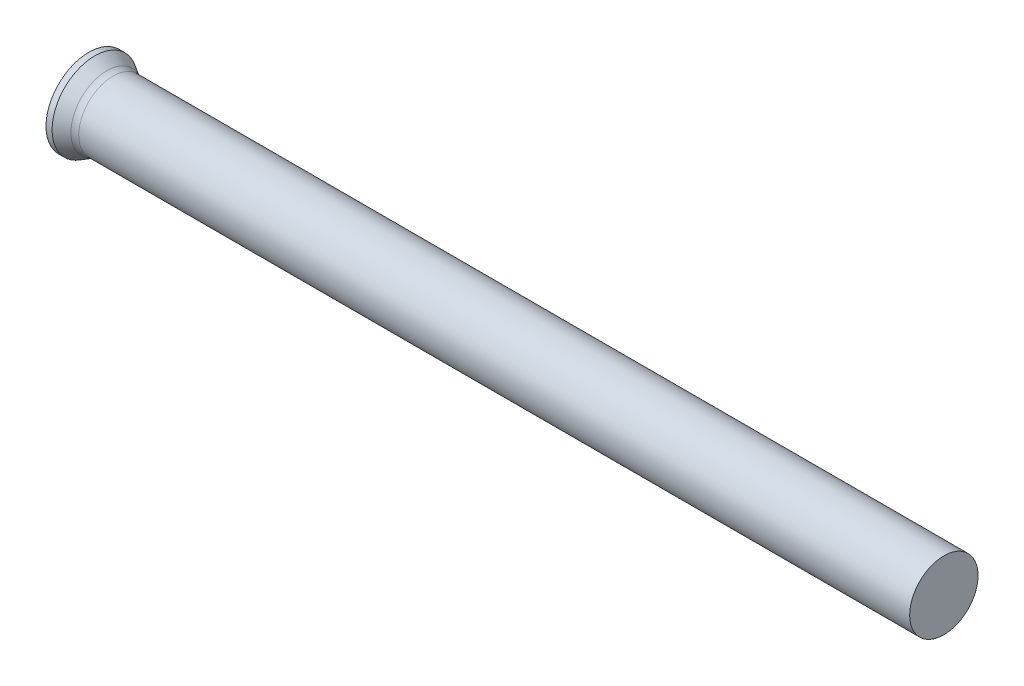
ISO-10303-21;
HEADER;
FILE_DESCRIPTION(('STEP AP214'),'2;1');
FILE_NAME('part.step','',(''),(''),'','','');
FILE_SCHEMA(('AUTOMOTIVE_DESIGN { 1 0 10303 214 1 1 1 1 }'));
ENDSEC;
DATA;
#1=APPLICATION_CONTEXT('core data for automotive mechanical design processes');
#2=APPLICATION_PROTOCOL_DEFINITION('international standard','automotive_design',2000,#1);
#3=PRODUCT_CONTEXT('',#1,'mechanical');
#4=PRODUCT('Part','Part','',(#3));
#5=PRODUCT_RELATED_PRODUCT_CATEGORY('part','',(#4));
#6=PRODUCT_DEFINITION_FORMATION('','',#4);
#7=PRODUCT_DEFINITION_CONTEXT('part definition',#1,'design');
#8=PRODUCT_DEFINITION('design','',#6,#7);
#9=PRODUCT_DEFINITION_SHAPE('','',#8);
#10=(LENGTH_UNIT() NAMED_UNIT(*) SI_UNIT(.MILLI.,.METRE.));
#11=(NAMED_UNIT(*) PLANE_ANGLE_UNIT() SI_UNIT($,.RADIAN.));
#12=(NAMED_UNIT(*) SI_UNIT($,.STERADIAN.) SOLID_ANGLE_UNIT());
#13=UNCERTAINTY_MEASURE_WITH_UNIT(LENGTH_MEASURE(1.E-05),#10,'distance_accuracy_value','');
#14=(GEOMETRIC_REPRESENTATION_CONTEXT(3) GLOBAL_UNCERTAINTY_ASSIGNED_CONTEXT((#13)) GLOBAL_UNIT_ASSIGNED_CONTEXT((#10,
#11,#12)) REPRESENTATION_CONTEXT('',''));
#15=CARTESIAN_POINT('',(0.,0.,0.));
#16=DIRECTION('',(0.,0.,1.));
#17=DIRECTION('',(1.,0.,0.));
#18=AXIS2_PLACEMENT_3D('',#15,#16,#17);
#19=CARTESIAN_POINT('',(0.,0.,0.));
#20=DIRECTION('',(1.,0.,0.));
#21=DIRECTION('',(0.,0.,-1.));
#22=AXIS2_PLACEMENT_3D('',#19,#20,#21);
#23=PLANE('',#22);
#24=CARTESIAN_POINT('',(0.,0.,0.));
#25=DIRECTION('',(-1.,0.,0.));
#26=DIRECTION('',(0.,0.,1.));
#27=AXIS2_PLACEMENT_3D('',#24,#25,#26);
#28=CIRCLE('',#27,3.5);
#29=CARTESIAN_POINT('',(0.,0.,3.5));
#30=VERTEX_POINT('',#29);
#31=EDGE_CURVE('E25',#30,#30,#28,.T.);
#32=ORIENTED_EDGE('',*,*,#31,.T.);
#33=EDGE_LOOP('',(#32));
#34=FACE_BOUND('',#33,.T.);
#35=ADVANCED_FACE('F14',(#34),#23,.F.);
#36=CARTESIAN_POINT('',(0.,0.,0.));
#37=DIRECTION('',(-1.,0.,0.));
#38=DIRECTION('',(0.,0.,1.));
#39=AXIS2_PLACEMENT_3D('',#36,#37,#38);
#40=CYLINDRICAL_SURFACE('',#39,3.5);
#41=ORIENTED_EDGE('',*,*,#31,.F.);
#42=EDGE_LOOP('',(#41));
#43=FACE_BOUND('',#42,.T.);
#44=CARTESIAN_POINT('',(0.497564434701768,0.,0.));
#45=DIRECTION('',(-1.,0.,0.));
#46=DIRECTION('',(0.,0.,1.));
#47=AXIS2_PLACEMENT_3D('',#44,#45,#46);
#48=CIRCLE('',#47,3.5);
#49=CARTESIAN_POINT('',(0.497564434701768,0.,3.5));
#50=VERTEX_POINT('',#49);
#51=EDGE_CURVE('E29',#50,#50,#48,.T.);
#52=ORIENTED_EDGE('',*,*,#51,.T.);
#53=EDGE_LOOP('',(#52));
#54=FACE_BOUND('',#53,.T.);
#55=ADVANCED_FACE('F53',(#43,#54),#40,.T.);
#56=CARTESIAN_POINT('',(1.71,0.,0.));
#57=DIRECTION('',(-1.,0.,0.));
#58=DIRECTION('',(0.,0.,1.));
#59=AXIS2_PLACEMENT_3D('',#56,#57,#58);
#60=CONICAL_SURFACE('',#59,2.8,0.523598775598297);
#61=CARTESIAN_POINT('',(1.47794919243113,0.,0.));
#62=DIRECTION('',(-1.,0.,0.));
#63=DIRECTION('',(0.,0.,1.));
#64=AXIS2_PLACEMENT_3D('',#61,#62,#63);
#65=CIRCLE('',#64,2.93397459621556);
#66=CARTESIAN_POINT('',(1.47794919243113,0.,2.93397459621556));
#67=VERTEX_POINT('',#66);
#68=EDGE_CURVE('E21',#67,#67,#65,.T.);
#69=ORIENTED_EDGE('',*,*,#68,.T.);
#70=EDGE_LOOP('',(#69));
#71=FACE_BOUND('',#70,.T.);
#72=ORIENTED_EDGE('',*,*,#51,.F.);
#73=EDGE_LOOP('',(#72));
#74=FACE_BOUND('',#73,.T.);
#75=ADVANCED_FACE('F50',(#71,#74),#60,.T.);
#76=CARTESIAN_POINT('',(0.,0.,0.));
#77=DIRECTION('',(-1.,0.,0.));
#78=DIRECTION('',(0.,0.,1.));
#79=AXIS2_PLACEMENT_3D('',#76,#77,#78);
#80=CYLINDRICAL_SURFACE('',#79,2.8);
#81=CARTESIAN_POINT('',(1.97794919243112,0.,0.));
#82=DIRECTION('',(-1.,0.,0.));
#83=DIRECTION('',(0.,0.,1.));
#84=AXIS2_PLACEMENT_3D('',#81,#82,#83);
#85=CIRCLE('',#84,2.8);
#86=CARTESIAN_POINT('',(1.97794919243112,0.,2.8));
#87=VERTEX_POINT('',#86);
#88=EDGE_CURVE('E9',#87,#87,#85,.F.);
#89=ORIENTED_EDGE('',*,*,#88,.T.);
#90=EDGE_LOOP('',(#89));
#91=FACE_BOUND('',#90,.T.);
#92=CARTESIAN_POINT('',(70.,0.,0.));
#93=DIRECTION('',(-1.,0.,0.));
#94=DIRECTION('',(0.,0.,1.));
#95=AXIS2_PLACEMENT_3D('',#92,#93,#94);
#96=CIRCLE('',#95,2.8);
#97=CARTESIAN_POINT('',(70.,0.,2.8));
#98=VERTEX_POINT('',#97);
#99=EDGE_CURVE('E34',#98,#98,#96,.T.);
#100=ORIENTED_EDGE('',*,*,#99,.T.);
#101=EDGE_LOOP('',(#100));
#102=FACE_BOUND('',#101,.T.);
#103=ADVANCED_FACE('F38',(#91,#102),#80,.T.);
#104=CARTESIAN_POINT('',(70.,2.8,0.));
#105=DIRECTION('',(-1.,0.,0.));
#106=DIRECTION('',(0.,0.,1.));
#107=AXIS2_PLACEMENT_3D('',#104,#105,#106);
#108=PLANE('',#107);
#109=ORIENTED_EDGE('',*,*,#99,.F.);
#110=EDGE_LOOP('',(#109));
#111=FACE_BOUND('',#110,.T.);
#112=ADVANCED_FACE('F40',(#111),#108,.F.);
#113=CARTESIAN_POINT('',(1.97794919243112,0.,0.));
#114=DIRECTION('',(-1.,0.,0.));
#115=DIRECTION('',(0.,0.,1.));
#116=AXIS2_PLACEMENT_3D('',#113,#114,#115);
#117=TOROIDAL_SURFACE('',#116,3.8,1.);
#118=ORIENTED_EDGE('',*,*,#88,.F.);
#119=EDGE_LOOP('',(#118));
#120=FACE_BOUND('',#119,.T.);
#121=ORIENTED_EDGE('',*,*,#68,.F.);
#122=EDGE_LOOP('',(#121));
#123=FACE_BOUND('',#122,.T.);
#124=ADVANCED_FACE('F16',(#120,#123),#117,.F.);
#125=CLOSED_SHELL('',(#35,#55,#75,#103,#112,#124));
#126=MANIFOLD_SOLID_BREP('B1',#125);
#127=ADVANCED_BREP_SHAPE_REPRESENTATION('',(#18,#126),#14);
#128=SHAPE_DEFINITION_REPRESENTATION(#9,#127);
ENDSEC;
END-ISO-10303-21;
